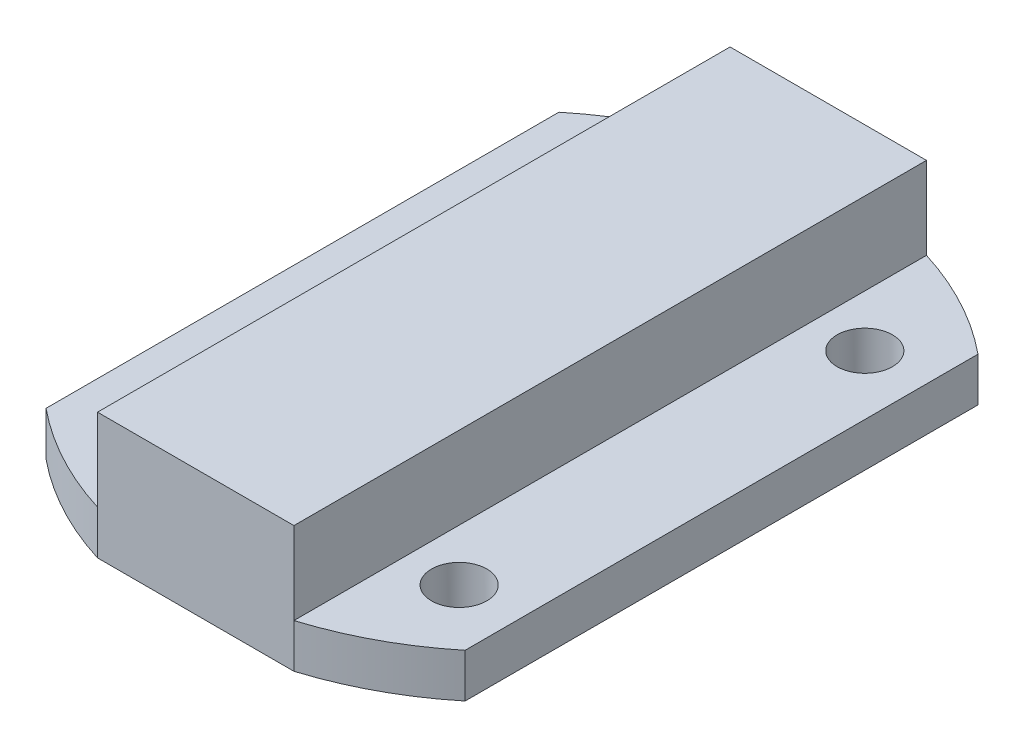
ISO-10303-21;
HEADER;
FILE_DESCRIPTION(('STEP AP214'),'2;1');
FILE_NAME('part.step','',(''),(''),'','','');
FILE_SCHEMA(('AUTOMOTIVE_DESIGN { 1 0 10303 214 1 1 1 1 }'));
ENDSEC;
DATA;
#1=APPLICATION_CONTEXT('core data for automotive mechanical design processes');
#2=APPLICATION_PROTOCOL_DEFINITION('international standard','automotive_design',2000,#1);
#3=PRODUCT_CONTEXT('',#1,'mechanical');
#4=PRODUCT('Part','Part','',(#3));
#5=PRODUCT_RELATED_PRODUCT_CATEGORY('part','',(#4));
#6=PRODUCT_DEFINITION_FORMATION('','',#4);
#7=PRODUCT_DEFINITION_CONTEXT('part definition',#1,'design');
#8=PRODUCT_DEFINITION('design','',#6,#7);
#9=PRODUCT_DEFINITION_SHAPE('','',#8);
#10=(LENGTH_UNIT() NAMED_UNIT(*) SI_UNIT(.MILLI.,.METRE.));
#11=(NAMED_UNIT(*) PLANE_ANGLE_UNIT() SI_UNIT($,.RADIAN.));
#12=(NAMED_UNIT(*) SI_UNIT($,.STERADIAN.) SOLID_ANGLE_UNIT());
#13=UNCERTAINTY_MEASURE_WITH_UNIT(LENGTH_MEASURE(1.E-05),#10,'distance_accuracy_value','');
#14=(GEOMETRIC_REPRESENTATION_CONTEXT(3) GLOBAL_UNCERTAINTY_ASSIGNED_CONTEXT((#13)) GLOBAL_UNIT_ASSIGNED_CONTEXT((#10,
#11,#12)) REPRESENTATION_CONTEXT('',''));
#15=CARTESIAN_POINT('',(0.,0.,0.));
#16=DIRECTION('',(0.,0.,1.));
#17=DIRECTION('',(1.,0.,0.));
#18=AXIS2_PLACEMENT_3D('',#15,#16,#17);
#19=CARTESIAN_POINT('',(-7.5057,1.5748,22.6568));
#20=DIRECTION('',(0.,-1.,0.));
#21=DIRECTION('',(0.,0.,-1.));
#22=AXIS2_PLACEMENT_3D('',#19,#20,#21);
#23=PLANE('',#22);
#24=CARTESIAN_POINT('',(-5.37209999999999,1.5748,8.382));
#25=DIRECTION('',(0.,-1.,0.));
#26=DIRECTION('',(0.,0.,-1.));
#27=AXIS2_PLACEMENT_3D('',#24,#25,#26);
#28=CIRCLE('',#27,0.9906);
#29=CARTESIAN_POINT('',(-5.37209999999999,1.5748,7.3914));
#30=VERTEX_POINT('',#29);
#31=EDGE_CURVE('E260',#30,#30,#28,.T.);
#32=ORIENTED_EDGE('',*,*,#31,.T.);
#33=EDGE_LOOP('',(#32));
#34=FACE_BOUND('',#33,.T.);
#35=CARTESIAN_POINT('',(0.,1.5748,11.3284));
#36=DIRECTION('',(0.,-1.,0.));
#37=DIRECTION('',(0.,0.,-1.));
#38=AXIS2_PLACEMENT_3D('',#35,#36,#37);
#39=CIRCLE('',#38,11.8620515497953);
#40=CARTESIAN_POINT('',(-3.51790000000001,1.5748,22.6568));
#41=VERTEX_POINT('',#40);
#42=CARTESIAN_POINT('',(-7.5057,1.5748,20.5138632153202));
#43=VERTEX_POINT('',#42);
#44=EDGE_CURVE('E247',#41,#43,#39,.T.);
#45=ORIENTED_EDGE('',*,*,#44,.F.);
#46=DIRECTION('',(0.,0.,-1.));
#47=VECTOR('',#46,1.);
#48=CARTESIAN_POINT('',(-3.5179,1.5748,22.6568));
#49=LINE('',#48,#47);
#50=CARTESIAN_POINT('',(-3.5179,1.5748,0.));
#51=VERTEX_POINT('',#50);
#52=EDGE_CURVE('E205',#41,#51,#49,.T.);
#53=ORIENTED_EDGE('',*,*,#52,.T.);
#54=CARTESIAN_POINT('',(-7.5057,1.5748,2.14293678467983));
#55=VERTEX_POINT('',#54);
#56=EDGE_CURVE('E244',#55,#51,#39,.T.);
#57=ORIENTED_EDGE('',*,*,#56,.F.);
#58=DIRECTION('',(0.,0.,-1.));
#59=VECTOR('',#58,1.);
#60=CARTESIAN_POINT('',(-7.5057,1.5748,22.6568));
#61=LINE('',#60,#59);
#62=EDGE_CURVE('E201',#43,#55,#61,.T.);
#63=ORIENTED_EDGE('',*,*,#62,.F.);
#64=EDGE_LOOP('',(#45,#53,#57,#63));
#65=FACE_BOUND('',#64,.T.);
#66=ADVANCED_FACE('F39',(#34,#65),#23,.F.);
#67=CARTESIAN_POINT('',(-7.5057,0.,22.6568));
#68=DIRECTION('',(1.,0.,0.));
#69=DIRECTION('',(0.,0.,-1.));
#70=AXIS2_PLACEMENT_3D('',#67,#68,#69);
#71=PLANE('',#70);
#72=DIRECTION('',(0.,1.,0.));
#73=VECTOR('',#72,1.);
#74=CARTESIAN_POINT('',(-7.5057,0.,2.14293678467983));
#75=LINE('',#74,#73);
#76=CARTESIAN_POINT('',(-7.5057,0.,2.14293678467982));
#77=VERTEX_POINT('',#76);
#78=EDGE_CURVE('E145',#77,#55,#75,.T.);
#79=ORIENTED_EDGE('',*,*,#78,.F.);
#80=DIRECTION('',(0.,0.,-1.));
#81=VECTOR('',#80,1.);
#82=CARTESIAN_POINT('',(-7.5057,0.,22.6568));
#83=LINE('',#82,#81);
#84=CARTESIAN_POINT('',(-7.5057,0.,20.5138632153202));
#85=VERTEX_POINT('',#84);
#86=EDGE_CURVE('E197',#85,#77,#83,.T.);
#87=ORIENTED_EDGE('',*,*,#86,.F.);
#88=DIRECTION('',(0.,1.,0.));
#89=VECTOR('',#88,1.);
#90=CARTESIAN_POINT('',(-7.5057,0.,20.5138632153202));
#91=LINE('',#90,#89);
#92=EDGE_CURVE('E253',#43,#85,#91,.F.);
#93=ORIENTED_EDGE('',*,*,#92,.F.);
#94=ORIENTED_EDGE('',*,*,#62,.T.);
#95=EDGE_LOOP('',(#79,#87,#93,#94));
#96=FACE_BOUND('',#95,.T.);
#97=ADVANCED_FACE('F290',(#96),#71,.F.);
#98=CARTESIAN_POINT('',(7.5057,0.,22.6568));
#99=DIRECTION('',(0.,1.,0.));
#100=DIRECTION('',(0.,0.,1.));
#101=AXIS2_PLACEMENT_3D('',#98,#99,#100);
#102=PLANE('',#101);
#103=CARTESIAN_POINT('',(-5.37209999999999,0.,8.382));
#104=DIRECTION('',(0.,1.,0.));
#105=DIRECTION('',(0.,0.,1.));
#106=AXIS2_PLACEMENT_3D('',#103,#104,#105);
#107=CIRCLE('',#106,0.9906);
#108=CARTESIAN_POINT('',(-5.37209999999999,0.,9.3726));
#109=VERTEX_POINT('',#108);
#110=EDGE_CURVE('E256',#109,#109,#107,.T.);
#111=ORIENTED_EDGE('',*,*,#110,.T.);
#112=EDGE_LOOP('',(#111));
#113=FACE_BOUND('',#112,.T.);
#114=CARTESIAN_POINT('',(5.37209999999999,0.,4.064));
#115=DIRECTION('',(0.,1.,0.));
#116=DIRECTION('',(0.,0.,1.));
#117=AXIS2_PLACEMENT_3D('',#114,#115,#116);
#118=CIRCLE('',#117,0.990599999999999);
#119=CARTESIAN_POINT('',(5.37209999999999,0.,5.0546));
#120=VERTEX_POINT('',#119);
#121=EDGE_CURVE('E224',#120,#120,#118,.T.);
#122=ORIENTED_EDGE('',*,*,#121,.T.);
#123=EDGE_LOOP('',(#122));
#124=FACE_BOUND('',#123,.T.);
#125=CARTESIAN_POINT('',(5.3721,0.,18.5928));
#126=DIRECTION('',(0.,1.,0.));
#127=DIRECTION('',(0.,0.,1.));
#128=AXIS2_PLACEMENT_3D('',#125,#126,#127);
#129=CIRCLE('',#128,0.990599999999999);
#130=CARTESIAN_POINT('',(5.3721,0.,19.5834));
#131=VERTEX_POINT('',#130);
#132=EDGE_CURVE('E220',#131,#131,#129,.T.);
#133=ORIENTED_EDGE('',*,*,#132,.T.);
#134=EDGE_LOOP('',(#133));
#135=FACE_BOUND('',#134,.T.);
#136=CARTESIAN_POINT('',(0.,0.,11.3284));
#137=DIRECTION('',(0.,1.,0.));
#138=DIRECTION('',(0.,0.,1.));
#139=AXIS2_PLACEMENT_3D('',#136,#137,#138);
#140=CIRCLE('',#139,11.8620515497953);
#141=CARTESIAN_POINT('',(3.51790000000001,0.,22.6568));
#142=VERTEX_POINT('',#141);
#143=CARTESIAN_POINT('',(7.5057,0.,20.5138632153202));
#144=VERTEX_POINT('',#143);
#145=EDGE_CURVE('E136',#142,#144,#140,.T.);
#146=ORIENTED_EDGE('',*,*,#145,.F.);
#147=DIRECTION('',(1.,0.,0.));
#148=VECTOR('',#147,1.);
#149=CARTESIAN_POINT('',(7.5057,0.,22.6568));
#150=LINE('',#149,#148);
#151=CARTESIAN_POINT('',(-3.5179,0.,22.6568));
#152=VERTEX_POINT('',#151);
#153=EDGE_CURVE('E151',#152,#142,#150,.T.);
#154=ORIENTED_EDGE('',*,*,#153,.F.);
#155=EDGE_CURVE('E58',#85,#152,#140,.T.);
#156=ORIENTED_EDGE('',*,*,#155,.F.);
#157=ORIENTED_EDGE('',*,*,#86,.T.);
#158=CARTESIAN_POINT('',(-3.51790000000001,0.,0.));
#159=VERTEX_POINT('',#158);
#160=EDGE_CURVE('E234',#159,#77,#140,.T.);
#161=ORIENTED_EDGE('',*,*,#160,.F.);
#162=DIRECTION('',(1.,0.,0.));
#163=VECTOR('',#162,1.);
#164=CARTESIAN_POINT('',(7.5057,0.,0.));
#165=LINE('',#164,#163);
#166=CARTESIAN_POINT('',(3.51790000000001,0.,0.));
#167=VERTEX_POINT('',#166);
#168=EDGE_CURVE('E187',#159,#167,#165,.T.);
#169=ORIENTED_EDGE('',*,*,#168,.T.);
#170=CARTESIAN_POINT('',(7.5057,0.,2.14293678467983));
#171=VERTEX_POINT('',#170);
#172=EDGE_CURVE('E68',#171,#167,#140,.T.);
#173=ORIENTED_EDGE('',*,*,#172,.F.);
#174=DIRECTION('',(0.,0.,-1.));
#175=VECTOR('',#174,1.);
#176=CARTESIAN_POINT('',(7.5057,0.,22.6568));
#177=LINE('',#176,#175);
#178=EDGE_CURVE('E153',#144,#171,#177,.T.);
#179=ORIENTED_EDGE('',*,*,#178,.F.);
#180=EDGE_LOOP('',(#146,#154,#156,#157,#161,#169,#173,#179));
#181=FACE_BOUND('',#180,.T.);
#182=ADVANCED_FACE('F150',(#113,#124,#135,#181),#102,.F.);
#183=CARTESIAN_POINT('',(7.5057,0.,22.6568));
#184=DIRECTION('',(-1.,0.,0.));
#185=DIRECTION('',(0.,0.,1.));
#186=AXIS2_PLACEMENT_3D('',#183,#184,#185);
#187=PLANE('',#186);
#188=DIRECTION('',(0.,1.,0.));
#189=VECTOR('',#188,1.);
#190=CARTESIAN_POINT('',(7.5057,0.,20.5138632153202));
#191=LINE('',#190,#189);
#192=CARTESIAN_POINT('',(7.5057,1.5748,20.5138632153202));
#193=VERTEX_POINT('',#192);
#194=EDGE_CURVE('E249',#144,#193,#191,.T.);
#195=ORIENTED_EDGE('',*,*,#194,.F.);
#196=ORIENTED_EDGE('',*,*,#178,.T.);
#197=DIRECTION('',(0.,1.,0.));
#198=VECTOR('',#197,1.);
#199=CARTESIAN_POINT('',(7.5057,0.,2.14293678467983));
#200=LINE('',#199,#198);
#201=CARTESIAN_POINT('',(7.5057,1.5748,2.14293678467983));
#202=VERTEX_POINT('',#201);
#203=EDGE_CURVE('E242',#202,#171,#200,.F.);
#204=ORIENTED_EDGE('',*,*,#203,.F.);
#205=DIRECTION('',(0.,0.,-1.));
#206=VECTOR('',#205,1.);
#207=CARTESIAN_POINT('',(7.5057,1.5748,22.6568));
#208=LINE('',#207,#206);
#209=EDGE_CURVE('E168',#193,#202,#208,.T.);
#210=ORIENTED_EDGE('',*,*,#209,.F.);
#211=EDGE_LOOP('',(#195,#196,#204,#210));
#212=FACE_BOUND('',#211,.T.);
#213=ADVANCED_FACE('F299',(#212),#187,.F.);
#214=CARTESIAN_POINT('',(7.5057,1.5748,22.6568));
#215=DIRECTION('',(0.,-1.,0.));
#216=DIRECTION('',(0.,0.,-1.));
#217=AXIS2_PLACEMENT_3D('',#214,#215,#216);
#218=PLANE('',#217);
#219=CARTESIAN_POINT('',(5.37209999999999,1.5748,4.064));
#220=DIRECTION('',(0.,-1.,0.));
#221=DIRECTION('',(0.,0.,-1.));
#222=AXIS2_PLACEMENT_3D('',#219,#220,#221);
#223=CIRCLE('',#222,0.990599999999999);
#224=CARTESIAN_POINT('',(5.37209999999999,1.5748,3.0734));
#225=VERTEX_POINT('',#224);
#226=EDGE_CURVE('E221',#225,#225,#223,.T.);
#227=ORIENTED_EDGE('',*,*,#226,.T.);
#228=EDGE_LOOP('',(#227));
#229=FACE_BOUND('',#228,.T.);
#230=CARTESIAN_POINT('',(5.3721,1.5748,18.5928));
#231=DIRECTION('',(0.,-1.,0.));
#232=DIRECTION('',(0.,0.,-1.));
#233=AXIS2_PLACEMENT_3D('',#230,#231,#232);
#234=CIRCLE('',#233,0.990599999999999);
#235=CARTESIAN_POINT('',(5.3721,1.5748,17.6022));
#236=VERTEX_POINT('',#235);
#237=EDGE_CURVE('E180',#236,#236,#234,.T.);
#238=ORIENTED_EDGE('',*,*,#237,.T.);
#239=EDGE_LOOP('',(#238));
#240=FACE_BOUND('',#239,.T.);
#241=CARTESIAN_POINT('',(0.,1.5748,11.3284));
#242=DIRECTION('',(0.,-1.,0.));
#243=DIRECTION('',(0.,0.,-1.));
#244=AXIS2_PLACEMENT_3D('',#241,#242,#243);
#245=CIRCLE('',#244,11.8620515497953);
#246=CARTESIAN_POINT('',(3.51790000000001,1.5748,0.));
#247=VERTEX_POINT('',#246);
#248=EDGE_CURVE('E155',#247,#202,#245,.T.);
#249=ORIENTED_EDGE('',*,*,#248,.F.);
#250=DIRECTION('',(0.,0.,-1.));
#251=VECTOR('',#250,1.);
#252=CARTESIAN_POINT('',(3.5179,1.5748,22.6568));
#253=LINE('',#252,#251);
#254=CARTESIAN_POINT('',(3.5179,1.5748,22.6568));
#255=VERTEX_POINT('',#254);
#256=EDGE_CURVE('E161',#255,#247,#253,.T.);
#257=ORIENTED_EDGE('',*,*,#256,.F.);
#258=EDGE_CURVE('E139',#193,#255,#245,.T.);
#259=ORIENTED_EDGE('',*,*,#258,.F.);
#260=ORIENTED_EDGE('',*,*,#209,.T.);
#261=EDGE_LOOP('',(#249,#257,#259,#260));
#262=FACE_BOUND('',#261,.T.);
#263=ADVANCED_FACE('F294',(#229,#240,#262),#218,.F.);
#264=CARTESIAN_POINT('',(0.,0.,22.6568));
#265=DIRECTION('',(0.,0.,-1.));
#266=DIRECTION('',(-1.,0.,0.));
#267=AXIS2_PLACEMENT_3D('',#264,#265,#266);
#268=PLANE('',#267);
#269=DIRECTION('',(0.,1.,0.));
#270=VECTOR('',#269,1.);
#271=CARTESIAN_POINT('',(-3.51790000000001,0.,22.6568));
#272=LINE('',#271,#270);
#273=EDGE_CURVE('E159',#152,#41,#272,.T.);
#274=ORIENTED_EDGE('',*,*,#273,.F.);
#275=ORIENTED_EDGE('',*,*,#153,.T.);
#276=DIRECTION('',(0.,1.,0.));
#277=VECTOR('',#276,1.);
#278=CARTESIAN_POINT('',(3.51790000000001,0.,22.6568));
#279=LINE('',#278,#277);
#280=EDGE_CURVE('E133',#255,#142,#279,.F.);
#281=ORIENTED_EDGE('',*,*,#280,.F.);
#282=DIRECTION('',(0.,1.,0.));
#283=VECTOR('',#282,1.);
#284=CARTESIAN_POINT('',(3.5179,1.5748,22.6568));
#285=LINE('',#284,#283);
#286=CARTESIAN_POINT('',(3.5179,4.5212,22.6568));
#287=VERTEX_POINT('',#286);
#288=EDGE_CURVE('E190',#255,#287,#285,.T.);
#289=ORIENTED_EDGE('',*,*,#288,.T.);
#290=DIRECTION('',(-1.,0.,0.));
#291=VECTOR('',#290,1.);
#292=CARTESIAN_POINT('',(-3.5179,4.5212,22.6568));
#293=LINE('',#292,#291);
#294=CARTESIAN_POINT('',(-3.5179,4.5212,22.6568));
#295=VERTEX_POINT('',#294);
#296=EDGE_CURVE('E171',#287,#295,#293,.T.);
#297=ORIENTED_EDGE('',*,*,#296,.T.);
#298=DIRECTION('',(0.,-1.,0.));
#299=VECTOR('',#298,1.);
#300=CARTESIAN_POINT('',(-3.5179,1.5748,22.6568));
#301=LINE('',#300,#299);
#302=EDGE_CURVE('E162',#295,#41,#301,.T.);
#303=ORIENTED_EDGE('',*,*,#302,.T.);
#304=EDGE_LOOP('',(#274,#275,#281,#289,#297,#303));
#305=FACE_BOUND('',#304,.T.);
#306=ADVANCED_FACE('F157',(#305),#268,.F.);
#307=CARTESIAN_POINT('',(0.,0.,0.));
#308=DIRECTION('',(0.,0.,-1.));
#309=DIRECTION('',(-1.,0.,0.));
#310=AXIS2_PLACEMENT_3D('',#307,#308,#309);
#311=PLANE('',#310);
#312=ORIENTED_EDGE('',*,*,#168,.F.);
#313=DIRECTION('',(0.,1.,0.));
#314=VECTOR('',#313,1.);
#315=CARTESIAN_POINT('',(-3.51790000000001,0.,0.));
#316=LINE('',#315,#314);
#317=EDGE_CURVE('E12',#159,#51,#316,.T.);
#318=ORIENTED_EDGE('',*,*,#317,.T.);
#319=DIRECTION('',(0.,-1.,0.));
#320=VECTOR('',#319,1.);
#321=CARTESIAN_POINT('',(-3.5179,1.5748,0.));
#322=LINE('',#321,#320);
#323=CARTESIAN_POINT('',(-3.5179,4.5212,0.));
#324=VERTEX_POINT('',#323);
#325=EDGE_CURVE('E183',#324,#51,#322,.T.);
#326=ORIENTED_EDGE('',*,*,#325,.F.);
#327=DIRECTION('',(-1.,0.,0.));
#328=VECTOR('',#327,1.);
#329=CARTESIAN_POINT('',(-3.5179,4.5212,0.));
#330=LINE('',#329,#328);
#331=CARTESIAN_POINT('',(3.5179,4.5212,0.));
#332=VERTEX_POINT('',#331);
#333=EDGE_CURVE('E179',#332,#324,#330,.T.);
#334=ORIENTED_EDGE('',*,*,#333,.F.);
#335=DIRECTION('',(0.,1.,0.));
#336=VECTOR('',#335,1.);
#337=CARTESIAN_POINT('',(3.5179,1.5748,0.));
#338=LINE('',#337,#336);
#339=EDGE_CURVE('E175',#247,#332,#338,.T.);
#340=ORIENTED_EDGE('',*,*,#339,.F.);
#341=DIRECTION('',(0.,1.,0.));
#342=VECTOR('',#341,1.);
#343=CARTESIAN_POINT('',(3.51790000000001,0.,0.));
#344=LINE('',#343,#342);
#345=EDGE_CURVE('E48',#247,#167,#344,.F.);
#346=ORIENTED_EDGE('',*,*,#345,.T.);
#347=EDGE_LOOP('',(#312,#318,#326,#334,#340,#346));
#348=FACE_BOUND('',#347,.T.);
#349=ADVANCED_FACE('F231',(#348),#311,.T.);
#350=CARTESIAN_POINT('',(3.5179,1.5748,22.6568));
#351=DIRECTION('',(-1.,0.,0.));
#352=DIRECTION('',(0.,0.,1.));
#353=AXIS2_PLACEMENT_3D('',#350,#351,#352);
#354=PLANE('',#353);
#355=ORIENTED_EDGE('',*,*,#339,.T.);
#356=DIRECTION('',(0.,0.,-1.));
#357=VECTOR('',#356,1.);
#358=CARTESIAN_POINT('',(3.5179,4.5212,22.6568));
#359=LINE('',#358,#357);
#360=EDGE_CURVE('E213',#287,#332,#359,.T.);
#361=ORIENTED_EDGE('',*,*,#360,.F.);
#362=ORIENTED_EDGE('',*,*,#288,.F.);
#363=ORIENTED_EDGE('',*,*,#256,.T.);
#364=EDGE_LOOP('',(#355,#361,#362,#363));
#365=FACE_BOUND('',#364,.T.);
#366=ADVANCED_FACE('F41',(#365),#354,.F.);
#367=CARTESIAN_POINT('',(-3.5179,4.5212,22.6568));
#368=DIRECTION('',(0.,-1.,0.));
#369=DIRECTION('',(0.,0.,-1.));
#370=AXIS2_PLACEMENT_3D('',#367,#368,#369);
#371=PLANE('',#370);
#372=ORIENTED_EDGE('',*,*,#333,.T.);
#373=DIRECTION('',(0.,0.,-1.));
#374=VECTOR('',#373,1.);
#375=CARTESIAN_POINT('',(-3.5179,4.5212,22.6568));
#376=LINE('',#375,#374);
#377=EDGE_CURVE('E209',#295,#324,#376,.T.);
#378=ORIENTED_EDGE('',*,*,#377,.F.);
#379=ORIENTED_EDGE('',*,*,#296,.F.);
#380=ORIENTED_EDGE('',*,*,#360,.T.);
#381=EDGE_LOOP('',(#372,#378,#379,#380));
#382=FACE_BOUND('',#381,.T.);
#383=ADVANCED_FACE('F279',(#382),#371,.F.);
#384=CARTESIAN_POINT('',(-3.5179,1.5748,22.6568));
#385=DIRECTION('',(1.,0.,0.));
#386=DIRECTION('',(0.,0.,-1.));
#387=AXIS2_PLACEMENT_3D('',#384,#385,#386);
#388=PLANE('',#387);
#389=ORIENTED_EDGE('',*,*,#325,.T.);
#390=ORIENTED_EDGE('',*,*,#52,.F.);
#391=ORIENTED_EDGE('',*,*,#302,.F.);
#392=ORIENTED_EDGE('',*,*,#377,.T.);
#393=EDGE_LOOP('',(#389,#390,#391,#392));
#394=FACE_BOUND('',#393,.T.);
#395=ADVANCED_FACE('F282',(#394),#388,.F.);
#396=CARTESIAN_POINT('',(5.3721,0.,18.5928));
#397=DIRECTION('',(0.,1.,0.));
#398=DIRECTION('',(0.,0.,1.));
#399=AXIS2_PLACEMENT_3D('',#396,#397,#398);
#400=CYLINDRICAL_SURFACE('',#399,0.990599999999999);
#401=ORIENTED_EDGE('',*,*,#132,.F.);
#402=EDGE_LOOP('',(#401));
#403=FACE_BOUND('',#402,.T.);
#404=ORIENTED_EDGE('',*,*,#237,.F.);
#405=EDGE_LOOP('',(#404));
#406=FACE_BOUND('',#405,.T.);
#407=ADVANCED_FACE('F319',(#403,#406),#400,.F.);
#408=CARTESIAN_POINT('',(5.37209999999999,0.,4.064));
#409=DIRECTION('',(0.,1.,0.));
#410=DIRECTION('',(0.,0.,1.));
#411=AXIS2_PLACEMENT_3D('',#408,#409,#410);
#412=CYLINDRICAL_SURFACE('',#411,0.990599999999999);
#413=ORIENTED_EDGE('',*,*,#121,.F.);
#414=EDGE_LOOP('',(#413));
#415=FACE_BOUND('',#414,.T.);
#416=ORIENTED_EDGE('',*,*,#226,.F.);
#417=EDGE_LOOP('',(#416));
#418=FACE_BOUND('',#417,.T.);
#419=ADVANCED_FACE('F335',(#415,#418),#412,.F.);
#420=CARTESIAN_POINT('',(-5.37209999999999,0.,8.382));
#421=DIRECTION('',(0.,1.,0.));
#422=DIRECTION('',(0.,0.,1.));
#423=AXIS2_PLACEMENT_3D('',#420,#421,#422);
#424=CYLINDRICAL_SURFACE('',#423,0.9906);
#425=ORIENTED_EDGE('',*,*,#110,.F.);
#426=EDGE_LOOP('',(#425));
#427=FACE_BOUND('',#426,.T.);
#428=ORIENTED_EDGE('',*,*,#31,.F.);
#429=EDGE_LOOP('',(#428));
#430=FACE_BOUND('',#429,.T.);
#431=ADVANCED_FACE('F339',(#427,#430),#424,.F.);
#432=CARTESIAN_POINT('',(0.,0.,11.3284));
#433=DIRECTION('',(0.,1.,0.));
#434=DIRECTION('',(0.,0.,1.));
#435=AXIS2_PLACEMENT_3D('',#432,#433,#434);
#436=CYLINDRICAL_SURFACE('',#435,11.8620515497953);
#437=ORIENTED_EDGE('',*,*,#203,.T.);
#438=ORIENTED_EDGE('',*,*,#172,.T.);
#439=ORIENTED_EDGE('',*,*,#345,.F.);
#440=ORIENTED_EDGE('',*,*,#248,.T.);
#441=EDGE_LOOP('',(#437,#438,#439,#440));
#442=FACE_BOUND('',#441,.T.);
#443=ADVANCED_FACE('F297',(#442),#436,.T.);
#444=ORIENTED_EDGE('',*,*,#78,.T.);
#445=ORIENTED_EDGE('',*,*,#56,.T.);
#446=ORIENTED_EDGE('',*,*,#317,.F.);
#447=ORIENTED_EDGE('',*,*,#160,.T.);
#448=EDGE_LOOP('',(#444,#445,#446,#447));
#449=FACE_BOUND('',#448,.T.);
#450=ADVANCED_FACE('F291',(#449),#436,.T.);
#451=ORIENTED_EDGE('',*,*,#194,.T.);
#452=ORIENTED_EDGE('',*,*,#258,.T.);
#453=ORIENTED_EDGE('',*,*,#280,.T.);
#454=ORIENTED_EDGE('',*,*,#145,.T.);
#455=EDGE_LOOP('',(#451,#452,#453,#454));
#456=FACE_BOUND('',#455,.T.);
#457=ADVANCED_FACE('F135',(#456),#436,.T.);
#458=ORIENTED_EDGE('',*,*,#92,.T.);
#459=ORIENTED_EDGE('',*,*,#155,.T.);
#460=ORIENTED_EDGE('',*,*,#273,.T.);
#461=ORIENTED_EDGE('',*,*,#44,.T.);
#462=EDGE_LOOP('',(#458,#459,#460,#461));
#463=FACE_BOUND('',#462,.T.);
#464=ADVANCED_FACE('F288',(#463),#436,.T.);
#465=CLOSED_SHELL('',(#66,#97,#182,#213,#263,#306,#349,#366,#383,#395,#407,#419,#431,#443,#450,
#457,#464));
#466=MANIFOLD_SOLID_BREP('B2',#465);
#467=ADVANCED_BREP_SHAPE_REPRESENTATION('',(#18,#466),#14);
#468=SHAPE_DEFINITION_REPRESENTATION(#9,#467);
ENDSEC;
END-ISO-10303-21;
